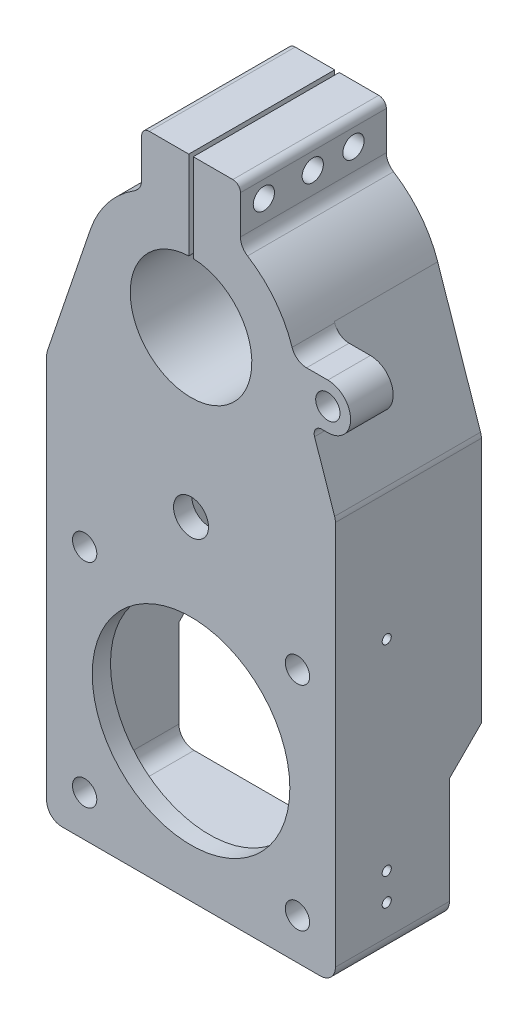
from build123d import *
from build123d.topology import SkipClean

# Parameters (mm, degrees)
SKETCH_1_R          = 65
SKETCH_1_R_2        = 8
SKETCH_1_R_3        = 11.5
SKETCH_1_R_4        = 40
EXTRUDE_1_DEPTH     = 28
EXTRUDE_START       = 68
SKETCH_2_R          = 65
SKETCH_2_R_2        = 8
SKETCH_2_R_3        = 11.5
SKETCH_2_R_4        = 40
EXTRUDE_2_DEPTH     = 68
CUT_EXTRUDE_2_DEPTH = 84
SKETCH_4_W          = 3
SKETCH_4_H          = 163.074091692
CUT_EXTRUDE_3_DEPTH = 84
SKETCH_5_R          = 7
CUT_EXTRUDE_4_DEPTH = 10
CUT_EXTRUDE_5_DEPTH = 190
SKETCH_7_R          = 3
CUT_EXTRUDE_6_DEPTH = 12
SKETCH_8_R          = 2.5
CUT_EXTRUDE_7_DEPTH = 12


with BuildPart() as part:
    # Sketch 1 → Extrude 1 (new body)
    with BuildSketch(Plane.XY):
        with BuildLine():
            Line((95, 166.347317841), (95, -87))
            ThreePointArc((95, -87), (92.071067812, -94.071067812), (85, -97))
            Line((85, -97), (-85, -97))
            ThreePointArc((-85, -97), (-92.071067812, -94.071067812), (-95, -87))
            Line((-95, -87), (-95, 166.347317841))
            ThreePointArc((-95, 166.347317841), (-94.866167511, 167.977881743), (-94.468252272, 169.564801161))
            Line((-94.468252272, 169.564801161), (-66.277765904, 252.52238324))
            ThreePointArc((-66.277765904, 252.52238324), (-54.904522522, 273.422268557), (-37.1875, 289.305057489))
            ThreePointArc((-37.1875, 289.305057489), (-33.75, 292.935979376), (-32.5, 297.777208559))
            Line((-32.5, 297.777208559), (-32.5, 323))
            ThreePointArc((-32.5, 323), (-31.035533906, 326.535533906), (-27.5, 328))
            Line((-27.5, 328), (0, 328))
            Line((0, 328), (27.5, 328))
            ThreePointArc((27.5, 328), (31.035533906, 326.535533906), (32.5, 323))
            Line((32.5, 323), (32.5, 297.777208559))
            ThreePointArc((32.5, 297.777208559), (33.75, 292.935979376), (37.1875, 289.305057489))
            ThreePointArc((37.1875, 289.305057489), (55.11559006, 273.154046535), (66.494243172, 251.875))
            ThreePointArc((66.494243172, 251.875), (70.130401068, 246.899074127), (75.993420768, 245))
            Line((75.993420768, 245), (90, 245))
            ThreePointArc((90, 245), (105, 230), (90, 215))
            Line((90, 215), (86.008446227, 215))
            ThreePointArc((86.008446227, 215), (81.943737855, 212.911725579), (81.274320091, 208.39125834))
            Line((81.274320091, 208.39125834), (94.468252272, 169.564801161))
            ThreePointArc((94.468252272, 169.564801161), (94.866167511, 167.977881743), (95, 166.347317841))
        make_face()
        Circle(SKETCH_1_R, mode=Mode.SUBTRACT)
        with Locations((-70, -70)):
            Circle(SKETCH_1_R_2, mode=Mode.SUBTRACT)
        with Locations((0, 122)):
            Circle(SKETCH_1_R_3, mode=Mode.SUBTRACT)
        with Locations((0, 230)):
            Circle(SKETCH_1_R_4, mode=Mode.SUBTRACT)
        with Locations((90, 230)):
            Circle(SKETCH_1_R_2, mode=Mode.SUBTRACT)
        with Locations(Location((-70, 70, 0), (0, 0, 180))):
            Circle(SKETCH_1_R_2, mode=Mode.SUBTRACT)
        with Locations(Location((70, -70, 0), (0, 0, 180))):
            Circle(SKETCH_1_R_2, mode=Mode.SUBTRACT)
        with Locations((70, 70)):
            Circle(SKETCH_1_R_2, mode=Mode.SUBTRACT)
    extrude(amount=EXTRUDE_1_DEPTH)

    # Sketch 2 → Extrude 2 (add)
    with SkipClean():  # the faces are left unmerged after this step: merging them gives an invalid solid
        with BuildSketch(Plane(origin=(0, 0, 0), x_dir=(-1, 0, 0), z_dir=(0, 0, -1)).offset(EXTRUDE_START)):
            with BuildLine():
                Line((85, -97), (-85, -97))
                ThreePointArc((-85, -97), (-92.071067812, -94.071067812), (-95, -87))
                Line((-95, -87), (-95, 166.347317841))
                ThreePointArc((-95, 166.347317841), (-94.866167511, 167.977881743), (-94.468252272, 169.564801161))
                Line((-94.468252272, 169.564801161), (-66.277765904, 252.52238324))
                ThreePointArc((-66.277765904, 252.52238324), (-54.904522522, 273.422268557), (-37.1875, 289.305057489))
                ThreePointArc((-37.1875, 289.305057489), (-33.75, 292.935979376), (-32.5, 297.777208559))
                Line((-32.5, 297.777208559), (-32.5, 323))
                ThreePointArc((-32.5, 323), (-31.035533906, 326.535533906), (-27.5, 328))
                Line((-27.5, 328), (27.5, 328))
                ThreePointArc((27.5, 328), (31.035533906, 326.535533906), (32.5, 323))
                Line((32.5, 323), (32.5, 297.777208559))
                ThreePointArc((32.5, 297.777208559), (33.75, 292.935979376), (37.1875, 289.305057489))
                ThreePointArc((37.1875, 289.305057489), (54.904522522, 273.422268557), (66.277765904, 252.52238324))
                Line((66.277765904, 252.52238324), (94.468252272, 169.564801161))
                ThreePointArc((94.468252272, 169.564801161), (94.866167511, 167.977881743), (95, 166.347317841))
                Line((95, 166.347317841), (95, -87))
                ThreePointArc((95, -87), (92.071067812, -94.071067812), (85, -97))
            make_face()
            Circle(SKETCH_2_R, mode=Mode.SUBTRACT)
            with Locations((70, -70)):
                Circle(SKETCH_2_R_2, mode=Mode.SUBTRACT)
            with Locations((70, 70)):
                Circle(SKETCH_2_R_2, mode=Mode.SUBTRACT)
            with Locations((0, 122)):
                Circle(SKETCH_2_R_3, mode=Mode.SUBTRACT)
            with Locations((-70, 70)):
                Circle(SKETCH_2_R_2, mode=Mode.SUBTRACT)
            with Locations((-70, -70)):
                Circle(SKETCH_2_R_2, mode=Mode.SUBTRACT)
            with Locations((0, 230)):
                Circle(SKETCH_2_R_4, mode=Mode.SUBTRACT)
        extrude(amount=-EXTRUDE_2_DEPTH)

    # Sketch 3 → Cut-Extrude 2 (cut)
    with SkipClean():  # the faces are left unmerged after this step: merging them gives an invalid solid
        with BuildSketch(Plane(origin=(0, 0, -68), x_dir=(-1, 0, 0), z_dir=(0, 0, -1))):
            with BuildLine():
                Line((83, 172.557094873), (83, -75))
                ThreePointArc((83, -75), (80.071067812, -82.071067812), (73, -85))
                Line((73, -85), (-73, -85))
                ThreePointArc((-73, -85), (-80.071067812, -82.071067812), (-83, -75))
                Line((-83, -75), (-83, 172.557094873))
                ThreePointArc((-83, 172.557094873), (-82.804945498, 174.968233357), (-82.224854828, 177.316664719))
                Line((-82.224854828, 177.316664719), (-80.720408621, 181.812980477))
                ThreePointArc((-80.720408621, 181.812980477), (-69.10392398, 191.824883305), (-54.7610443, 186.396926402))
                ThreePointArc((-54.7610443, 186.396926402), (0, 160), (54.7610443, 186.396926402))
                ThreePointArc((54.7610443, 186.396926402), (69.10392398, 191.824883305), (80.720408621, 181.812980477))
                Line((80.720408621, 181.812980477), (82.224854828, 177.316664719))
                ThreePointArc((82.224854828, 177.316664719), (82.804945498, 174.968233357), (83, 172.557094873))
            make_face()
        extrude(amount=-CUT_EXTRUDE_2_DEPTH, mode=Mode.SUBTRACT)

    # Sketch 4 → Cut-Extrude 3 (cut)
    with BuildSketch(Plane(origin=(0, 328, 0), x_dir=(1, 0, 0), z_dir=(0, 1, 0))):
        Rectangle(SKETCH_4_W, SKETCH_4_H)
    extrude(amount=-CUT_EXTRUDE_3_DEPTH, mode=Mode.SUBTRACT)

    # Sketch 5 → Cut-Extrude 4 (cut)
    with BuildSketch(Plane(origin=(32.5, 0, 0), x_dir=(0, 0, -1), z_dir=(1, 0, 0))):
        with Locations(Location((19.579968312, 312, 0), (0, 0, 90))):
            Circle(SKETCH_5_R)
        with Locations(Location((-12.583285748, 312, 0), (0, 0, 90))):
            Circle(SKETCH_5_R)
        with Locations(Location((46.382068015, 312, 0), (0, 0, 90))):
            Circle(SKETCH_5_R)
    extrude(amount=-CUT_EXTRUDE_4_DEPTH, mode=Mode.SUBTRACT)

    # Sketch 6 → Cut-Extrude 5 (cut)
    with BuildSketch(Plane(origin=(95, 0, 0), x_dir=(0, 0, -1), z_dir=(1, 0, 0))):
        Polygon((47, -97), (68, -97), (68, 4), (47, -17), align=None)
    extrude(amount=-CUT_EXTRUDE_5_DEPTH, mode=Mode.SUBTRACT)

    # Sketch 7 → Cut-Extrude 6 (cut)
    with BuildSketch(Plane(origin=(95, 0, 0), x_dir=(0, 0, -1), z_dir=(1, 0, 0))):
        with Locations(Location((5.744917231, -67, 0), (0, 0, 90))):
            Circle(SKETCH_7_R)
        with Locations(Location((5.744917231, -49, 0), (0, 0, 90))):
            Circle(SKETCH_7_R)
        with Locations(Location((5.744917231, 83, 0), (0, 0, 90))):
            Circle(SKETCH_7_R)
    extrude(amount=-CUT_EXTRUDE_6_DEPTH, mode=Mode.SUBTRACT)

    # Sketch 8 → Cut-Extrude 7 (cut)
    with BuildSketch(Plane(origin=(-136.344836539, 46.332440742, 0), x_dir=(0, 0, 1), z_dir=(-0.9468252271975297, 0.32174833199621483, 0))):
        with Locations(Location((-2, 183.128530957, 0), (0, 0, 270))):
            Circle(SKETCH_8_R)
        with Locations(Location((-2, 161.128530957, 0), (0, 0, 270))):
            Circle(SKETCH_8_R)
    extrude(amount=-CUT_EXTRUDE_7_DEPTH, mode=Mode.SUBTRACT)


solid = part.part
